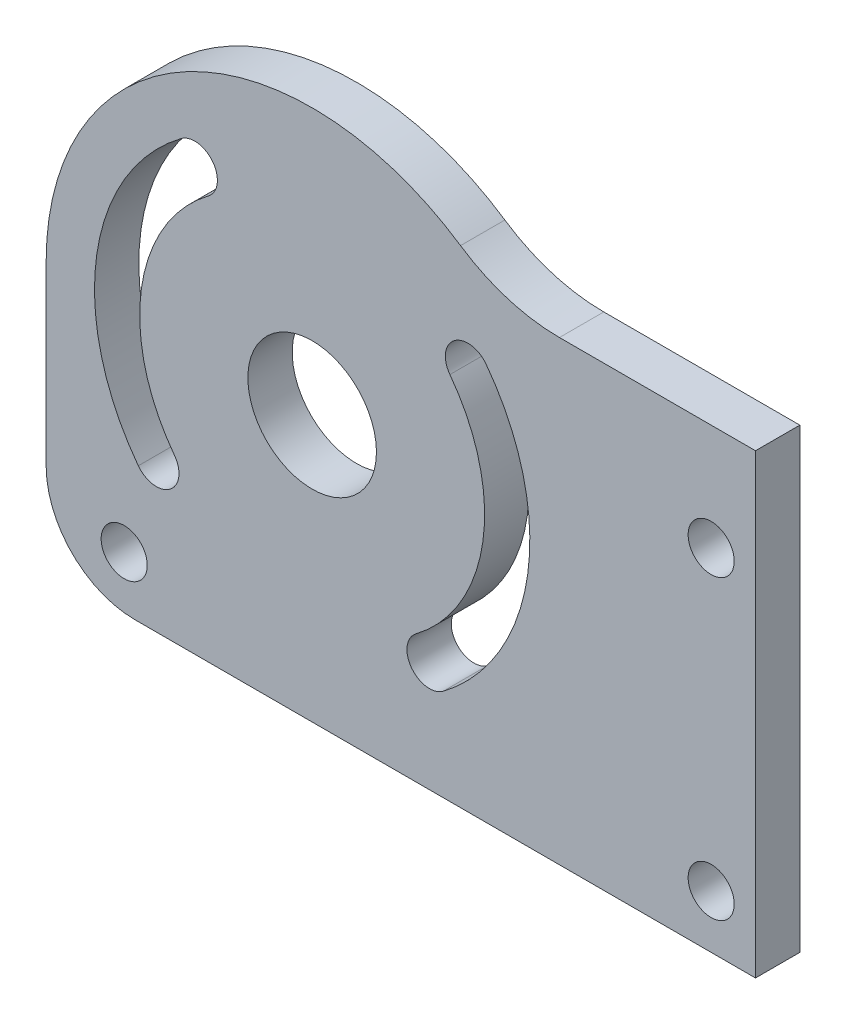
ISO-10303-21;
HEADER;
FILE_DESCRIPTION(('STEP AP214'),'2;1');
FILE_NAME('part.step','',(''),(''),'','','');
FILE_SCHEMA(('AUTOMOTIVE_DESIGN { 1 0 10303 214 1 1 1 1 }'));
ENDSEC;
DATA;
#1=APPLICATION_CONTEXT('core data for automotive mechanical design processes');
#2=APPLICATION_PROTOCOL_DEFINITION('international standard','automotive_design',2000,#1);
#3=PRODUCT_CONTEXT('',#1,'mechanical');
#4=PRODUCT('Part','Part','',(#3));
#5=PRODUCT_RELATED_PRODUCT_CATEGORY('part','',(#4));
#6=PRODUCT_DEFINITION_FORMATION('','',#4);
#7=PRODUCT_DEFINITION_CONTEXT('part definition',#1,'design');
#8=PRODUCT_DEFINITION('design','',#6,#7);
#9=PRODUCT_DEFINITION_SHAPE('','',#8);
#10=(LENGTH_UNIT() NAMED_UNIT(*) SI_UNIT(.MILLI.,.METRE.));
#11=(NAMED_UNIT(*) PLANE_ANGLE_UNIT() SI_UNIT($,.RADIAN.));
#12=(NAMED_UNIT(*) SI_UNIT($,.STERADIAN.) SOLID_ANGLE_UNIT());
#13=UNCERTAINTY_MEASURE_WITH_UNIT(LENGTH_MEASURE(1.E-05),#10,'distance_accuracy_value','');
#14=(GEOMETRIC_REPRESENTATION_CONTEXT(3) GLOBAL_UNCERTAINTY_ASSIGNED_CONTEXT((#13)) GLOBAL_UNIT_ASSIGNED_CONTEXT((#10,
#11,#12)) REPRESENTATION_CONTEXT('',''));
#15=CARTESIAN_POINT('',(0.,0.,0.));
#16=DIRECTION('',(0.,0.,1.));
#17=DIRECTION('',(1.,0.,0.));
#18=AXIS2_PLACEMENT_3D('',#15,#16,#17);
#19=CARTESIAN_POINT('',(-30.0000000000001,-20.0000000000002,4.99999999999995));
#20=DIRECTION('',(0.,0.,1.));
#21=DIRECTION('',(1.,0.,0.));
#22=AXIS2_PLACEMENT_3D('',#19,#20,#21);
#23=PLANE('',#22);
#24=CARTESIAN_POINT('',(-10.0000000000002,0.,4.99999999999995));
#25=DIRECTION('',(0.,0.,-1.));
#26=DIRECTION('',(-1.,0.,0.));
#27=AXIS2_PLACEMENT_3D('',#24,#25,#26);
#28=CIRCLE('',#27,19.45);
#29=CARTESIAN_POINT('',(-25.5334606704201,-11.7053022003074,5.));
#30=VERTEX_POINT('',#29);
#31=CARTESIAN_POINT('',(-21.7053022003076,15.5334606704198,5.));
#32=VERTEX_POINT('',#31);
#33=EDGE_CURVE('E55',#30,#32,#28,.T.);
#34=ORIENTED_EDGE('',*,*,#33,.F.);
#35=CARTESIAN_POINT('',(-27.5699812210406,-13.2399305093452,5.));
#36=DIRECTION('',(0.,0.,1.));
#37=DIRECTION('',(-1.,0.,0.));
#38=AXIS2_PLACEMENT_3D('',#35,#36,#37);
#39=CIRCLE('',#38,2.55);
#40=CARTESIAN_POINT('',(-29.6065017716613,-14.7745588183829,5.));
#41=VERTEX_POINT('',#40);
#42=EDGE_CURVE('E164',#41,#30,#39,.T.);
#43=ORIENTED_EDGE('',*,*,#42,.F.);
#44=CARTESIAN_POINT('',(-10.0000000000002,0.,4.99999999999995));
#45=DIRECTION('',(0.,0.,1.));
#46=DIRECTION('',(-1.,0.,0.));
#47=AXIS2_PLACEMENT_3D('',#44,#45,#46);
#48=CIRCLE('',#47,24.55);
#49=CARTESIAN_POINT('',(-24.7745588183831,19.6065017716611,4.99999999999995));
#50=VERTEX_POINT('',#49);
#51=EDGE_CURVE('E149',#50,#41,#48,.T.);
#52=ORIENTED_EDGE('',*,*,#51,.F.);
#53=CARTESIAN_POINT('',(-23.2399305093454,17.5699812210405,4.99999999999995));
#54=DIRECTION('',(0.,0.,1.));
#55=DIRECTION('',(-1.,0.,0.));
#56=AXIS2_PLACEMENT_3D('',#53,#54,#55);
#57=CIRCLE('',#56,2.55);
#58=EDGE_CURVE('E158',#32,#50,#57,.T.);
#59=ORIENTED_EDGE('',*,*,#58,.F.);
#60=EDGE_LOOP('',(#34,#43,#52,#59));
#61=FACE_BOUND('',#60,.T.);
#62=CARTESIAN_POINT('',(-10.0000000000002,0.,4.99999999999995));
#63=DIRECTION('',(0.,0.,1.));
#64=DIRECTION('',(1.,0.,0.));
#65=AXIS2_PLACEMENT_3D('',#62,#63,#64);
#66=CIRCLE('',#65,7.25);
#67=CARTESIAN_POINT('',(-2.75000000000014,0.,4.99999999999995));
#68=VERTEX_POINT('',#67);
#69=EDGE_CURVE('E180',#68,#68,#66,.T.);
#70=ORIENTED_EDGE('',*,*,#69,.F.);
#71=EDGE_LOOP('',(#70));
#72=FACE_BOUND('',#71,.T.);
#73=CARTESIAN_POINT('',(-10.0000000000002,0.,4.99999999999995));
#74=DIRECTION('',(0.,0.,-1.));
#75=DIRECTION('',(1.,0.,0.));
#76=AXIS2_PLACEMENT_3D('',#73,#74,#75);
#77=CIRCLE('',#76,19.45);
#78=CARTESIAN_POINT('',(5.5334606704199,11.7053022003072,5.));
#79=VERTEX_POINT('',#78);
#80=CARTESIAN_POINT('',(1.70530220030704,-15.53346067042,5.));
#81=VERTEX_POINT('',#80);
#82=EDGE_CURVE('E188',#79,#81,#77,.T.);
#83=ORIENTED_EDGE('',*,*,#82,.F.);
#84=CARTESIAN_POINT('',(7.56998122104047,13.239930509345,5.));
#85=DIRECTION('',(0.,0.,1.));
#86=DIRECTION('',(1.,0.,0.));
#87=AXIS2_PLACEMENT_3D('',#84,#85,#86);
#88=CIRCLE('',#87,2.55);
#89=CARTESIAN_POINT('',(9.60650177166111,14.7745588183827,4.99999999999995));
#90=VERTEX_POINT('',#89);
#91=EDGE_CURVE('E196',#90,#79,#88,.T.);
#92=ORIENTED_EDGE('',*,*,#91,.F.);
#93=CARTESIAN_POINT('',(-10.0000000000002,0.,4.99999999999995));
#94=DIRECTION('',(0.,0.,1.));
#95=DIRECTION('',(1.,0.,0.));
#96=AXIS2_PLACEMENT_3D('',#93,#94,#95);
#97=CIRCLE('',#96,24.55);
#98=CARTESIAN_POINT('',(4.77455881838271,-19.6065017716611,5.));
#99=VERTEX_POINT('',#98);
#100=EDGE_CURVE('E193',#99,#90,#97,.T.);
#101=ORIENTED_EDGE('',*,*,#100,.F.);
#102=CARTESIAN_POINT('',(3.23993050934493,-17.5699812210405,5.));
#103=DIRECTION('',(0.,0.,1.));
#104=DIRECTION('',(1.,0.,0.));
#105=AXIS2_PLACEMENT_3D('',#102,#103,#104);
#106=CIRCLE('',#105,2.55);
#107=EDGE_CURVE('E190',#81,#99,#106,.T.);
#108=ORIENTED_EDGE('',*,*,#107,.F.);
#109=EDGE_LOOP('',(#83,#92,#101,#108));
#110=FACE_BOUND('',#109,.T.);
#111=CARTESIAN_POINT('',(35.0000000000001,-24.0000000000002,4.99999999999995));
#112=DIRECTION('',(0.,0.,1.));
#113=DIRECTION('',(1.,0.,0.));
#114=AXIS2_PLACEMENT_3D('',#111,#112,#113);
#115=CIRCLE('',#114,2.6);
#116=CARTESIAN_POINT('',(37.6000000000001,-24.0000000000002,4.99999999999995));
#117=VERTEX_POINT('',#116);
#118=EDGE_CURVE('E229',#117,#117,#115,.T.);
#119=ORIENTED_EDGE('',*,*,#118,.F.);
#120=EDGE_LOOP('',(#119));
#121=FACE_BOUND('',#120,.T.);
#122=DIRECTION('',(0.,1.,0.));
#123=VECTOR('',#122,1.);
#124=CARTESIAN_POINT('',(40.0000000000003,21.5000000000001,4.99999999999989));
#125=LINE('',#124,#123);
#126=CARTESIAN_POINT('',(40.0000000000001,-30.0000000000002,4.99999999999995));
#127=VERTEX_POINT('',#126);
#128=CARTESIAN_POINT('',(40.0000000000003,21.5000000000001,4.99999999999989));
#129=VERTEX_POINT('',#128);
#130=EDGE_CURVE('E253',#127,#129,#125,.T.);
#131=ORIENTED_EDGE('',*,*,#130,.T.);
#132=DIRECTION('',(-1.,0.,0.));
#133=VECTOR('',#132,1.);
#134=CARTESIAN_POINT('',(40.0000000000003,21.5000000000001,4.99999999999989));
#135=LINE('',#134,#133);
#136=CARTESIAN_POINT('',(17.8881695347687,21.5000000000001,4.99999999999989));
#137=VERTEX_POINT('',#136);
#138=EDGE_CURVE('E256',#129,#137,#135,.T.);
#139=ORIENTED_EDGE('',*,*,#138,.T.);
#140=CARTESIAN_POINT('',(17.8881695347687,41.5000000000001,4.99999999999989));
#141=DIRECTION('',(0.,0.,-1.));
#142=DIRECTION('',(1.,0.,0.));
#143=AXIS2_PLACEMENT_3D('',#140,#141,#142);
#144=CIRCLE('',#143,20.);
#145=CARTESIAN_POINT('',(6.73290172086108,24.9000000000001,5.));
#146=VERTEX_POINT('',#145);
#147=EDGE_CURVE('E258',#137,#146,#144,.T.);
#148=ORIENTED_EDGE('',*,*,#147,.T.);
#149=CARTESIAN_POINT('',(-10.,0.,5.));
#150=DIRECTION('',(0.,0.,1.));
#151=DIRECTION('',(1.,0.,0.));
#152=AXIS2_PLACEMENT_3D('',#149,#150,#151);
#153=CIRCLE('',#152,30.);
#154=CARTESIAN_POINT('',(-40.0000000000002,0.,4.99999999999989));
#155=VERTEX_POINT('',#154);
#156=EDGE_CURVE('E260',#146,#155,#153,.T.);
#157=ORIENTED_EDGE('',*,*,#156,.T.);
#158=DIRECTION('',(0.,-1.,0.));
#159=VECTOR('',#158,1.);
#160=CARTESIAN_POINT('',(-40.0000000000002,0.,4.99999999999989));
#161=LINE('',#160,#159);
#162=CARTESIAN_POINT('',(-40.0000000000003,-20.,4.99999999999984));
#163=VERTEX_POINT('',#162);
#164=EDGE_CURVE('E262',#155,#163,#161,.T.);
#165=ORIENTED_EDGE('',*,*,#164,.T.);
#166=CARTESIAN_POINT('',(-30.0000000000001,-20.0000000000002,4.99999999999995));
#167=DIRECTION('',(0.,0.,1.));
#168=DIRECTION('',(1.,0.,0.));
#169=AXIS2_PLACEMENT_3D('',#166,#167,#168);
#170=CIRCLE('',#169,10.);
#171=CARTESIAN_POINT('',(-30.0000000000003,-30.0000000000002,5.));
#172=VERTEX_POINT('',#171);
#173=EDGE_CURVE('E264',#163,#172,#170,.T.);
#174=ORIENTED_EDGE('',*,*,#173,.T.);
#175=DIRECTION('',(1.,0.,0.));
#176=VECTOR('',#175,1.);
#177=CARTESIAN_POINT('',(-30.0000000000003,-30.0000000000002,5.));
#178=LINE('',#177,#176);
#179=EDGE_CURVE('E266',#172,#127,#178,.T.);
#180=ORIENTED_EDGE('',*,*,#179,.T.);
#181=EDGE_LOOP('',(#131,#139,#148,#157,#165,#174,#180));
#182=FACE_BOUND('',#181,.T.);
#183=CARTESIAN_POINT('',(34.9999999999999,9.4999999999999,4.99999999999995));
#184=DIRECTION('',(0.,0.,1.));
#185=DIRECTION('',(1.,0.,0.));
#186=AXIS2_PLACEMENT_3D('',#183,#184,#185);
#187=CIRCLE('',#186,2.6);
#188=CARTESIAN_POINT('',(37.5999999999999,9.4999999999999,4.99999999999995));
#189=VERTEX_POINT('',#188);
#190=EDGE_CURVE('E235',#189,#189,#187,.T.);
#191=ORIENTED_EDGE('',*,*,#190,.F.);
#192=EDGE_LOOP('',(#191));
#193=FACE_BOUND('',#192,.T.);
#194=CARTESIAN_POINT('',(-31.2000000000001,-24.0000000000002,4.99999999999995));
#195=DIRECTION('',(0.,0.,1.));
#196=DIRECTION('',(1.,0.,0.));
#197=AXIS2_PLACEMENT_3D('',#194,#195,#196);
#198=CIRCLE('',#197,2.6);
#199=CARTESIAN_POINT('',(-28.6000000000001,-24.0000000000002,4.99999999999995));
#200=VERTEX_POINT('',#199);
#201=EDGE_CURVE('E223',#200,#200,#198,.T.);
#202=ORIENTED_EDGE('',*,*,#201,.F.);
#203=EDGE_LOOP('',(#202));
#204=FACE_BOUND('',#203,.T.);
#205=ADVANCED_FACE('F40',(#61,#72,#110,#121,#182,#193,#204),#23,.T.);
#206=CARTESIAN_POINT('',(-30.0000000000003,-20.0000000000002,0.));
#207=DIRECTION('',(0.,0.,1.));
#208=DIRECTION('',(1.,0.,0.));
#209=AXIS2_PLACEMENT_3D('',#206,#207,#208);
#210=PLANE('',#209);
#211=CARTESIAN_POINT('',(-27.5699812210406,-13.2399305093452,0.));
#212=DIRECTION('',(0.,0.,1.));
#213=DIRECTION('',(-1.,0.,0.));
#214=AXIS2_PLACEMENT_3D('',#211,#212,#213);
#215=CIRCLE('',#214,2.55);
#216=CARTESIAN_POINT('',(-29.6065017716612,-14.7745588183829,0.));
#217=VERTEX_POINT('',#216);
#218=CARTESIAN_POINT('',(-25.5334606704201,-11.7053022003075,0.));
#219=VERTEX_POINT('',#218);
#220=EDGE_CURVE('E175',#217,#219,#215,.T.);
#221=ORIENTED_EDGE('',*,*,#220,.T.);
#222=CARTESIAN_POINT('',(-10.0000000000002,0.,0.));
#223=DIRECTION('',(0.,0.,-1.));
#224=DIRECTION('',(-1.,0.,0.));
#225=AXIS2_PLACEMENT_3D('',#222,#223,#224);
#226=CIRCLE('',#225,19.45);
#227=CARTESIAN_POINT('',(-21.7053022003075,15.5334606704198,0.));
#228=VERTEX_POINT('',#227);
#229=EDGE_CURVE('E166',#219,#228,#226,.T.);
#230=ORIENTED_EDGE('',*,*,#229,.T.);
#231=CARTESIAN_POINT('',(-23.2399305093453,17.5699812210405,0.));
#232=DIRECTION('',(0.,0.,1.));
#233=DIRECTION('',(-1.,0.,0.));
#234=AXIS2_PLACEMENT_3D('',#231,#232,#233);
#235=CIRCLE('',#234,2.55);
#236=CARTESIAN_POINT('',(-24.7745588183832,19.6065017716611,0.));
#237=VERTEX_POINT('',#236);
#238=EDGE_CURVE('E172',#228,#237,#235,.T.);
#239=ORIENTED_EDGE('',*,*,#238,.T.);
#240=CARTESIAN_POINT('',(-10.0000000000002,0.,0.));
#241=DIRECTION('',(0.,0.,1.));
#242=DIRECTION('',(-1.,0.,0.));
#243=AXIS2_PLACEMENT_3D('',#240,#241,#242);
#244=CIRCLE('',#243,24.55);
#245=EDGE_CURVE('E63',#237,#217,#244,.T.);
#246=ORIENTED_EDGE('',*,*,#245,.T.);
#247=EDGE_LOOP('',(#221,#230,#239,#246));
#248=FACE_BOUND('',#247,.T.);
#249=CARTESIAN_POINT('',(-10.0000000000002,0.,0.));
#250=DIRECTION('',(0.,0.,1.));
#251=DIRECTION('',(1.,0.,0.));
#252=AXIS2_PLACEMENT_3D('',#249,#250,#251);
#253=CIRCLE('',#252,7.25);
#254=CARTESIAN_POINT('',(-2.75000000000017,0.,0.));
#255=VERTEX_POINT('',#254);
#256=EDGE_CURVE('E185',#255,#255,#253,.T.);
#257=ORIENTED_EDGE('',*,*,#256,.T.);
#258=EDGE_LOOP('',(#257));
#259=FACE_BOUND('',#258,.T.);
#260=CARTESIAN_POINT('',(7.56998122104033,13.239930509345,0.));
#261=DIRECTION('',(0.,0.,1.));
#262=DIRECTION('',(1.,0.,0.));
#263=AXIS2_PLACEMENT_3D('',#260,#261,#262);
#264=CIRCLE('',#263,2.55);
#265=CARTESIAN_POINT('',(9.60650177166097,14.7745588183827,-1.11022302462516E-13));
#266=VERTEX_POINT('',#265);
#267=CARTESIAN_POINT('',(5.53346067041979,11.7053022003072,0.));
#268=VERTEX_POINT('',#267);
#269=EDGE_CURVE('E208',#266,#268,#264,.T.);
#270=ORIENTED_EDGE('',*,*,#269,.T.);
#271=CARTESIAN_POINT('',(-10.0000000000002,0.,0.));
#272=DIRECTION('',(0.,0.,-1.));
#273=DIRECTION('',(1.,0.,0.));
#274=AXIS2_PLACEMENT_3D('',#271,#272,#273);
#275=CIRCLE('',#274,19.45);
#276=CARTESIAN_POINT('',(1.70530220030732,-15.53346067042,0.));
#277=VERTEX_POINT('',#276);
#278=EDGE_CURVE('E199',#268,#277,#275,.T.);
#279=ORIENTED_EDGE('',*,*,#278,.T.);
#280=CARTESIAN_POINT('',(3.23993050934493,-17.5699812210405,0.));
#281=DIRECTION('',(0.,0.,1.));
#282=DIRECTION('',(1.,0.,0.));
#283=AXIS2_PLACEMENT_3D('',#280,#281,#282);
#284=CIRCLE('',#283,2.55);
#285=CARTESIAN_POINT('',(4.77455881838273,-19.6065017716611,0.));
#286=VERTEX_POINT('',#285);
#287=EDGE_CURVE('E202',#277,#286,#284,.T.);
#288=ORIENTED_EDGE('',*,*,#287,.T.);
#289=CARTESIAN_POINT('',(-10.0000000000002,0.,0.));
#290=DIRECTION('',(0.,0.,1.));
#291=DIRECTION('',(1.,0.,0.));
#292=AXIS2_PLACEMENT_3D('',#289,#290,#291);
#293=CIRCLE('',#292,24.55);
#294=EDGE_CURVE('E205',#286,#266,#293,.T.);
#295=ORIENTED_EDGE('',*,*,#294,.T.);
#296=EDGE_LOOP('',(#270,#279,#288,#295));
#297=FACE_BOUND('',#296,.T.);
#298=CARTESIAN_POINT('',(35.0000000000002,-24.0000000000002,0.));
#299=DIRECTION('',(0.,0.,1.));
#300=DIRECTION('',(1.,0.,0.));
#301=AXIS2_PLACEMENT_3D('',#298,#299,#300);
#302=CIRCLE('',#301,2.6);
#303=CARTESIAN_POINT('',(37.6000000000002,-24.0000000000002,0.));
#304=VERTEX_POINT('',#303);
#305=EDGE_CURVE('E226',#304,#304,#302,.T.);
#306=ORIENTED_EDGE('',*,*,#305,.T.);
#307=EDGE_LOOP('',(#306));
#308=FACE_BOUND('',#307,.T.);
#309=DIRECTION('',(0.,1.,0.));
#310=VECTOR('',#309,1.);
#311=CARTESIAN_POINT('',(40.0000000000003,21.5000000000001,-1.11022302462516E-13));
#312=LINE('',#311,#310);
#313=CARTESIAN_POINT('',(40.0000000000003,-30.0000000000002,0.));
#314=VERTEX_POINT('',#313);
#315=CARTESIAN_POINT('',(40.0000000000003,21.5000000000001,-1.11022302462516E-13));
#316=VERTEX_POINT('',#315);
#317=EDGE_CURVE('E238',#314,#316,#312,.T.);
#318=ORIENTED_EDGE('',*,*,#317,.F.);
#319=DIRECTION('',(1.,0.,0.));
#320=VECTOR('',#319,1.);
#321=CARTESIAN_POINT('',(-30.0000000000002,-30.0000000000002,0.));
#322=LINE('',#321,#320);
#323=CARTESIAN_POINT('',(-30.0000000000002,-30.0000000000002,0.));
#324=VERTEX_POINT('',#323);
#325=EDGE_CURVE('E251',#324,#314,#322,.T.);
#326=ORIENTED_EDGE('',*,*,#325,.F.);
#327=CARTESIAN_POINT('',(-30.0000000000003,-20.0000000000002,0.));
#328=DIRECTION('',(0.,0.,1.));
#329=DIRECTION('',(1.,0.,0.));
#330=AXIS2_PLACEMENT_3D('',#327,#328,#329);
#331=CIRCLE('',#330,10.);
#332=CARTESIAN_POINT('',(-40.0000000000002,-20.,-1.66533453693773E-13));
#333=VERTEX_POINT('',#332);
#334=EDGE_CURVE('E249',#333,#324,#331,.T.);
#335=ORIENTED_EDGE('',*,*,#334,.F.);
#336=DIRECTION('',(0.,-1.,0.));
#337=VECTOR('',#336,1.);
#338=CARTESIAN_POINT('',(-40.0000000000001,0.,0.));
#339=LINE('',#338,#337);
#340=CARTESIAN_POINT('',(-40.0000000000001,0.,0.));
#341=VERTEX_POINT('',#340);
#342=EDGE_CURVE('E247',#341,#333,#339,.T.);
#343=ORIENTED_EDGE('',*,*,#342,.F.);
#344=CARTESIAN_POINT('',(-10.0000000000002,0.,0.));
#345=DIRECTION('',(0.,0.,1.));
#346=DIRECTION('',(1.,0.,0.));
#347=AXIS2_PLACEMENT_3D('',#344,#345,#346);
#348=CIRCLE('',#347,30.);
#349=CARTESIAN_POINT('',(6.73290172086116,24.9000000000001,-1.11022302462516E-13));
#350=VERTEX_POINT('',#349);
#351=EDGE_CURVE('E245',#350,#341,#348,.T.);
#352=ORIENTED_EDGE('',*,*,#351,.F.);
#353=CARTESIAN_POINT('',(17.8881695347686,41.5000000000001,0.));
#354=DIRECTION('',(0.,0.,-1.));
#355=DIRECTION('',(1.,0.,0.));
#356=AXIS2_PLACEMENT_3D('',#353,#354,#355);
#357=CIRCLE('',#356,20.);
#358=CARTESIAN_POINT('',(17.8881695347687,21.5000000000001,0.));
#359=VERTEX_POINT('',#358);
#360=EDGE_CURVE('E243',#359,#350,#357,.T.);
#361=ORIENTED_EDGE('',*,*,#360,.F.);
#362=DIRECTION('',(-1.,0.,0.));
#363=VECTOR('',#362,1.);
#364=CARTESIAN_POINT('',(40.0000000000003,21.5000000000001,-1.11022302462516E-13));
#365=LINE('',#364,#363);
#366=EDGE_CURVE('E241',#316,#359,#365,.T.);
#367=ORIENTED_EDGE('',*,*,#366,.F.);
#368=EDGE_LOOP('',(#318,#326,#335,#343,#352,#361,#367));
#369=FACE_BOUND('',#368,.T.);
#370=CARTESIAN_POINT('',(35.,9.50000000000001,-1.66533453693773E-13));
#371=DIRECTION('',(0.,0.,1.));
#372=DIRECTION('',(1.,0.,0.));
#373=AXIS2_PLACEMENT_3D('',#370,#371,#372);
#374=CIRCLE('',#373,2.6);
#375=CARTESIAN_POINT('',(37.6,9.50000000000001,-1.66966440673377E-13));
#376=VERTEX_POINT('',#375);
#377=EDGE_CURVE('E232',#376,#376,#374,.T.);
#378=ORIENTED_EDGE('',*,*,#377,.T.);
#379=EDGE_LOOP('',(#378));
#380=FACE_BOUND('',#379,.T.);
#381=CARTESIAN_POINT('',(-31.2000000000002,-24.0000000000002,-1.11022302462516E-13));
#382=DIRECTION('',(0.,0.,1.));
#383=DIRECTION('',(1.,0.,0.));
#384=AXIS2_PLACEMENT_3D('',#381,#382,#383);
#385=CIRCLE('',#384,2.6);
#386=CARTESIAN_POINT('',(-28.6000000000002,-24.0000000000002,-1.11455289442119E-13));
#387=VERTEX_POINT('',#386);
#388=EDGE_CURVE('E214',#387,#387,#385,.T.);
#389=ORIENTED_EDGE('',*,*,#388,.T.);
#390=EDGE_LOOP('',(#389));
#391=FACE_BOUND('',#390,.T.);
#392=ADVANCED_FACE('F293',(#248,#259,#297,#308,#369,#380,#391),#210,.F.);
#393=CARTESIAN_POINT('',(40.0000000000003,21.5000000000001,4.99999999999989));
#394=DIRECTION('',(-1.,0.,0.));
#395=DIRECTION('',(0.,-1.,0.));
#396=AXIS2_PLACEMENT_3D('',#393,#394,#395);
#397=PLANE('',#396);
#398=ORIENTED_EDGE('',*,*,#317,.T.);
#399=DIRECTION('',(0.,0.,-1.));
#400=VECTOR('',#399,1.);
#401=CARTESIAN_POINT('',(40.0000000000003,21.5000000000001,4.99999999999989));
#402=LINE('',#401,#400);
#403=EDGE_CURVE('E11',#129,#316,#402,.T.);
#404=ORIENTED_EDGE('',*,*,#403,.F.);
#405=ORIENTED_EDGE('',*,*,#130,.F.);
#406=DIRECTION('',(0.,0.,-1.));
#407=VECTOR('',#406,1.);
#408=CARTESIAN_POINT('',(40.0000000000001,-30.0000000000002,4.99999999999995));
#409=LINE('',#408,#407);
#410=EDGE_CURVE('E268',#127,#314,#409,.T.);
#411=ORIENTED_EDGE('',*,*,#410,.T.);
#412=EDGE_LOOP('',(#398,#404,#405,#411));
#413=FACE_BOUND('',#412,.T.);
#414=ADVANCED_FACE('F42',(#413),#397,.F.);
#415=CARTESIAN_POINT('',(40.0000000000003,21.5000000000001,4.99999999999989));
#416=DIRECTION('',(0.,-1.,0.));
#417=DIRECTION('',(1.,0.,0.));
#418=AXIS2_PLACEMENT_3D('',#415,#416,#417);
#419=PLANE('',#418);
#420=ORIENTED_EDGE('',*,*,#366,.T.);
#421=DIRECTION('',(0.,0.,-1.));
#422=VECTOR('',#421,1.);
#423=CARTESIAN_POINT('',(17.8881695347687,21.5000000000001,4.99999999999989));
#424=LINE('',#423,#422);
#425=EDGE_CURVE('E48',#137,#359,#424,.T.);
#426=ORIENTED_EDGE('',*,*,#425,.F.);
#427=ORIENTED_EDGE('',*,*,#138,.F.);
#428=ORIENTED_EDGE('',*,*,#403,.T.);
#429=EDGE_LOOP('',(#420,#426,#427,#428));
#430=FACE_BOUND('',#429,.T.);
#431=ADVANCED_FACE('F311',(#430),#419,.F.);
#432=CARTESIAN_POINT('',(17.8881695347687,41.5000000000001,4.99999999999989));
#433=DIRECTION('',(0.,0.,-1.));
#434=DIRECTION('',(-1.,0.,0.));
#435=AXIS2_PLACEMENT_3D('',#432,#433,#434);
#436=CYLINDRICAL_SURFACE('',#435,20.);
#437=ORIENTED_EDGE('',*,*,#360,.T.);
#438=DIRECTION('',(0.,0.,-1.));
#439=VECTOR('',#438,1.);
#440=CARTESIAN_POINT('',(6.73290172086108,24.9000000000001,5.));
#441=LINE('',#440,#439);
#442=EDGE_CURVE('E280',#146,#350,#441,.T.);
#443=ORIENTED_EDGE('',*,*,#442,.F.);
#444=ORIENTED_EDGE('',*,*,#147,.F.);
#445=ORIENTED_EDGE('',*,*,#425,.T.);
#446=EDGE_LOOP('',(#437,#443,#444,#445));
#447=FACE_BOUND('',#446,.T.);
#448=ADVANCED_FACE('F287',(#447),#436,.F.);
#449=CARTESIAN_POINT('',(-10.,0.,5.));
#450=DIRECTION('',(0.,0.,-1.));
#451=DIRECTION('',(-1.,0.,0.));
#452=AXIS2_PLACEMENT_3D('',#449,#450,#451);
#453=CYLINDRICAL_SURFACE('',#452,30.);
#454=ORIENTED_EDGE('',*,*,#351,.T.);
#455=DIRECTION('',(0.,0.,-1.));
#456=VECTOR('',#455,1.);
#457=CARTESIAN_POINT('',(-40.0000000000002,0.,4.99999999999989));
#458=LINE('',#457,#456);
#459=EDGE_CURVE('E277',#155,#341,#458,.T.);
#460=ORIENTED_EDGE('',*,*,#459,.F.);
#461=ORIENTED_EDGE('',*,*,#156,.F.);
#462=ORIENTED_EDGE('',*,*,#442,.T.);
#463=EDGE_LOOP('',(#454,#460,#461,#462));
#464=FACE_BOUND('',#463,.T.);
#465=ADVANCED_FACE('F299',(#464),#453,.T.);
#466=CARTESIAN_POINT('',(-40.0000000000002,0.,4.99999999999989));
#467=DIRECTION('',(1.,0.,0.));
#468=DIRECTION('',(0.,1.00000000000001,0.));
#469=AXIS2_PLACEMENT_3D('',#466,#467,#468);
#470=PLANE('',#469);
#471=ORIENTED_EDGE('',*,*,#342,.T.);
#472=DIRECTION('',(0.,0.,-1.));
#473=VECTOR('',#472,1.);
#474=CARTESIAN_POINT('',(-40.0000000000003,-20.,4.99999999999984));
#475=LINE('',#474,#473);
#476=EDGE_CURVE('E274',#163,#333,#475,.T.);
#477=ORIENTED_EDGE('',*,*,#476,.F.);
#478=ORIENTED_EDGE('',*,*,#164,.F.);
#479=ORIENTED_EDGE('',*,*,#459,.T.);
#480=EDGE_LOOP('',(#471,#477,#478,#479));
#481=FACE_BOUND('',#480,.T.);
#482=ADVANCED_FACE('F303',(#481),#470,.F.);
#483=CARTESIAN_POINT('',(-30.0000000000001,-20.0000000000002,4.99999999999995));
#484=DIRECTION('',(0.,0.,-1.));
#485=DIRECTION('',(-1.,0.,0.));
#486=AXIS2_PLACEMENT_3D('',#483,#484,#485);
#487=CYLINDRICAL_SURFACE('',#486,10.);
#488=ORIENTED_EDGE('',*,*,#334,.T.);
#489=DIRECTION('',(0.,0.,-1.));
#490=VECTOR('',#489,1.);
#491=CARTESIAN_POINT('',(-30.0000000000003,-30.0000000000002,5.));
#492=LINE('',#491,#490);
#493=EDGE_CURVE('E271',#172,#324,#492,.T.);
#494=ORIENTED_EDGE('',*,*,#493,.F.);
#495=ORIENTED_EDGE('',*,*,#173,.F.);
#496=ORIENTED_EDGE('',*,*,#476,.T.);
#497=EDGE_LOOP('',(#488,#494,#495,#496));
#498=FACE_BOUND('',#497,.T.);
#499=ADVANCED_FACE('F319',(#498),#487,.T.);
#500=CARTESIAN_POINT('',(-30.0000000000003,-30.0000000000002,5.));
#501=DIRECTION('',(0.,1.,0.));
#502=DIRECTION('',(-1.,0.,0.));
#503=AXIS2_PLACEMENT_3D('',#500,#501,#502);
#504=PLANE('',#503);
#505=ORIENTED_EDGE('',*,*,#325,.T.);
#506=ORIENTED_EDGE('',*,*,#410,.F.);
#507=ORIENTED_EDGE('',*,*,#179,.F.);
#508=ORIENTED_EDGE('',*,*,#493,.T.);
#509=EDGE_LOOP('',(#505,#506,#507,#508));
#510=FACE_BOUND('',#509,.T.);
#511=ADVANCED_FACE('F316',(#510),#504,.F.);
#512=CARTESIAN_POINT('',(34.9999999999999,9.4999999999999,4.99999999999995));
#513=DIRECTION('',(0.,0.,-1.));
#514=DIRECTION('',(-1.,0.,0.));
#515=AXIS2_PLACEMENT_3D('',#512,#513,#514);
#516=CYLINDRICAL_SURFACE('',#515,2.6);
#517=ORIENTED_EDGE('',*,*,#190,.T.);
#518=EDGE_LOOP('',(#517));
#519=FACE_BOUND('',#518,.T.);
#520=ORIENTED_EDGE('',*,*,#377,.F.);
#521=EDGE_LOOP('',(#520));
#522=FACE_BOUND('',#521,.T.);
#523=ADVANCED_FACE('F326',(#519,#522),#516,.F.);
#524=CARTESIAN_POINT('',(35.0000000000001,-24.0000000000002,4.99999999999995));
#525=DIRECTION('',(0.,0.,-1.));
#526=DIRECTION('',(-1.,0.,0.));
#527=AXIS2_PLACEMENT_3D('',#524,#525,#526);
#528=CYLINDRICAL_SURFACE('',#527,2.6);
#529=ORIENTED_EDGE('',*,*,#118,.T.);
#530=EDGE_LOOP('',(#529));
#531=FACE_BOUND('',#530,.T.);
#532=ORIENTED_EDGE('',*,*,#305,.F.);
#533=EDGE_LOOP('',(#532));
#534=FACE_BOUND('',#533,.T.);
#535=ADVANCED_FACE('F339',(#531,#534),#528,.F.);
#536=CARTESIAN_POINT('',(-31.2000000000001,-24.0000000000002,4.99999999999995));
#537=DIRECTION('',(0.,0.,-1.));
#538=DIRECTION('',(-1.,0.,0.));
#539=AXIS2_PLACEMENT_3D('',#536,#537,#538);
#540=CYLINDRICAL_SURFACE('',#539,2.6);
#541=ORIENTED_EDGE('',*,*,#201,.T.);
#542=EDGE_LOOP('',(#541));
#543=FACE_BOUND('',#542,.T.);
#544=ORIENTED_EDGE('',*,*,#388,.F.);
#545=EDGE_LOOP('',(#544));
#546=FACE_BOUND('',#545,.T.);
#547=ADVANCED_FACE('F343',(#543,#546),#540,.F.);
#548=CARTESIAN_POINT('',(-10.0000000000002,0.,0.));
#549=DIRECTION('',(0.,0.,1.));
#550=DIRECTION('',(1.,0.,0.));
#551=AXIS2_PLACEMENT_3D('',#548,#549,#550);
#552=CYLINDRICAL_SURFACE('',#551,19.45);
#553=ORIENTED_EDGE('',*,*,#82,.T.);
#554=DIRECTION('',(0.,0.,1.));
#555=VECTOR('',#554,1.);
#556=CARTESIAN_POINT('',(1.70530220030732,-15.53346067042,0.));
#557=LINE('',#556,#555);
#558=EDGE_CURVE('E211',#277,#81,#557,.T.);
#559=ORIENTED_EDGE('',*,*,#558,.F.);
#560=ORIENTED_EDGE('',*,*,#278,.F.);
#561=DIRECTION('',(0.,0.,1.));
#562=VECTOR('',#561,1.);
#563=CARTESIAN_POINT('',(5.53346067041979,11.7053022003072,0.));
#564=LINE('',#563,#562);
#565=EDGE_CURVE('E212',#268,#79,#564,.T.);
#566=ORIENTED_EDGE('',*,*,#565,.T.);
#567=EDGE_LOOP('',(#553,#559,#560,#566));
#568=FACE_BOUND('',#567,.T.);
#569=ADVANCED_FACE('F347',(#568),#552,.T.);
#570=CARTESIAN_POINT('',(7.56998122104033,13.239930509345,0.));
#571=DIRECTION('',(0.,0.,1.));
#572=DIRECTION('',(1.,0.,0.));
#573=AXIS2_PLACEMENT_3D('',#570,#571,#572);
#574=CYLINDRICAL_SURFACE('',#573,2.55);
#575=ORIENTED_EDGE('',*,*,#91,.T.);
#576=ORIENTED_EDGE('',*,*,#565,.F.);
#577=ORIENTED_EDGE('',*,*,#269,.F.);
#578=DIRECTION('',(0.,0.,1.));
#579=VECTOR('',#578,1.);
#580=CARTESIAN_POINT('',(9.60650177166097,14.7745588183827,-1.11022302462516E-13));
#581=LINE('',#580,#579);
#582=EDGE_CURVE('E215',#266,#90,#581,.T.);
#583=ORIENTED_EDGE('',*,*,#582,.T.);
#584=EDGE_LOOP('',(#575,#576,#577,#583));
#585=FACE_BOUND('',#584,.T.);
#586=ADVANCED_FACE('F351',(#585),#574,.F.);
#587=CARTESIAN_POINT('',(-10.0000000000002,0.,0.));
#588=DIRECTION('',(0.,0.,1.));
#589=DIRECTION('',(1.,0.,0.));
#590=AXIS2_PLACEMENT_3D('',#587,#588,#589);
#591=CYLINDRICAL_SURFACE('',#590,24.55);
#592=ORIENTED_EDGE('',*,*,#100,.T.);
#593=ORIENTED_EDGE('',*,*,#582,.F.);
#594=ORIENTED_EDGE('',*,*,#294,.F.);
#595=DIRECTION('',(0.,0.,1.));
#596=VECTOR('',#595,1.);
#597=CARTESIAN_POINT('',(4.77455881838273,-19.6065017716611,0.));
#598=LINE('',#597,#596);
#599=EDGE_CURVE('E217',#286,#99,#598,.T.);
#600=ORIENTED_EDGE('',*,*,#599,.T.);
#601=EDGE_LOOP('',(#592,#593,#594,#600));
#602=FACE_BOUND('',#601,.T.);
#603=ADVANCED_FACE('F357',(#602),#591,.F.);
#604=CARTESIAN_POINT('',(3.23993050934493,-17.5699812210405,0.));
#605=DIRECTION('',(0.,0.,1.));
#606=DIRECTION('',(1.,0.,0.));
#607=AXIS2_PLACEMENT_3D('',#604,#605,#606);
#608=CYLINDRICAL_SURFACE('',#607,2.55);
#609=ORIENTED_EDGE('',*,*,#107,.T.);
#610=ORIENTED_EDGE('',*,*,#599,.F.);
#611=ORIENTED_EDGE('',*,*,#287,.F.);
#612=ORIENTED_EDGE('',*,*,#558,.T.);
#613=EDGE_LOOP('',(#609,#610,#611,#612));
#614=FACE_BOUND('',#613,.T.);
#615=ADVANCED_FACE('F353',(#614),#608,.F.);
#616=CARTESIAN_POINT('',(-10.0000000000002,0.,0.));
#617=DIRECTION('',(0.,0.,1.));
#618=DIRECTION('',(1.,0.,0.));
#619=AXIS2_PLACEMENT_3D('',#616,#617,#618);
#620=CYLINDRICAL_SURFACE('',#619,7.25);
#621=ORIENTED_EDGE('',*,*,#256,.F.);
#622=EDGE_LOOP('',(#621));
#623=FACE_BOUND('',#622,.T.);
#624=ORIENTED_EDGE('',*,*,#69,.T.);
#625=EDGE_LOOP('',(#624));
#626=FACE_BOUND('',#625,.T.);
#627=ADVANCED_FACE('F356',(#623,#626),#620,.F.);
#628=CARTESIAN_POINT('',(-10.0000000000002,0.,0.));
#629=DIRECTION('',(0.,0.,1.));
#630=DIRECTION('',(1.,0.,0.));
#631=AXIS2_PLACEMENT_3D('',#628,#629,#630);
#632=CYLINDRICAL_SURFACE('',#631,19.45);
#633=ORIENTED_EDGE('',*,*,#33,.T.);
#634=DIRECTION('',(0.,0.,1.));
#635=VECTOR('',#634,1.);
#636=CARTESIAN_POINT('',(-21.7053022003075,15.5334606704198,0.));
#637=LINE('',#636,#635);
#638=EDGE_CURVE('E155',#228,#32,#637,.T.);
#639=ORIENTED_EDGE('',*,*,#638,.F.);
#640=ORIENTED_EDGE('',*,*,#229,.F.);
#641=DIRECTION('',(0.,0.,1.));
#642=VECTOR('',#641,1.);
#643=CARTESIAN_POINT('',(-25.5334606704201,-11.7053022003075,0.));
#644=LINE('',#643,#642);
#645=EDGE_CURVE('E178',#219,#30,#644,.T.);
#646=ORIENTED_EDGE('',*,*,#645,.T.);
#647=EDGE_LOOP('',(#633,#639,#640,#646));
#648=FACE_BOUND('',#647,.T.);
#649=ADVANCED_FACE('F367',(#648),#632,.T.);
#650=CARTESIAN_POINT('',(-27.5699812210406,-13.2399305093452,0.));
#651=DIRECTION('',(0.,0.,1.));
#652=DIRECTION('',(1.,0.,0.));
#653=AXIS2_PLACEMENT_3D('',#650,#651,#652);
#654=CYLINDRICAL_SURFACE('',#653,2.55);
#655=ORIENTED_EDGE('',*,*,#42,.T.);
#656=ORIENTED_EDGE('',*,*,#645,.F.);
#657=ORIENTED_EDGE('',*,*,#220,.F.);
#658=DIRECTION('',(0.,0.,1.));
#659=VECTOR('',#658,1.);
#660=CARTESIAN_POINT('',(-29.6065017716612,-14.7745588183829,0.));
#661=LINE('',#660,#659);
#662=EDGE_CURVE('E154',#217,#41,#661,.T.);
#663=ORIENTED_EDGE('',*,*,#662,.T.);
#664=EDGE_LOOP('',(#655,#656,#657,#663));
#665=FACE_BOUND('',#664,.T.);
#666=ADVANCED_FACE('F371',(#665),#654,.F.);
#667=CARTESIAN_POINT('',(-10.0000000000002,0.,0.));
#668=DIRECTION('',(0.,0.,1.));
#669=DIRECTION('',(1.,0.,0.));
#670=AXIS2_PLACEMENT_3D('',#667,#668,#669);
#671=CYLINDRICAL_SURFACE('',#670,24.55);
#672=ORIENTED_EDGE('',*,*,#51,.T.);
#673=ORIENTED_EDGE('',*,*,#662,.F.);
#674=ORIENTED_EDGE('',*,*,#245,.F.);
#675=DIRECTION('',(0.,0.,1.));
#676=VECTOR('',#675,1.);
#677=CARTESIAN_POINT('',(-24.7745588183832,19.6065017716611,0.));
#678=LINE('',#677,#676);
#679=EDGE_CURVE('E145',#237,#50,#678,.T.);
#680=ORIENTED_EDGE('',*,*,#679,.T.);
#681=EDGE_LOOP('',(#672,#673,#674,#680));
#682=FACE_BOUND('',#681,.T.);
#683=ADVANCED_FACE('F147',(#682),#671,.F.);
#684=CARTESIAN_POINT('',(-23.2399305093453,17.5699812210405,0.));
#685=DIRECTION('',(0.,0.,1.));
#686=DIRECTION('',(1.,0.,0.));
#687=AXIS2_PLACEMENT_3D('',#684,#685,#686);
#688=CYLINDRICAL_SURFACE('',#687,2.55);
#689=ORIENTED_EDGE('',*,*,#58,.T.);
#690=ORIENTED_EDGE('',*,*,#679,.F.);
#691=ORIENTED_EDGE('',*,*,#238,.F.);
#692=ORIENTED_EDGE('',*,*,#638,.T.);
#693=EDGE_LOOP('',(#689,#690,#691,#692));
#694=FACE_BOUND('',#693,.T.);
#695=ADVANCED_FACE('F159',(#694),#688,.F.);
#696=CLOSED_SHELL('',(#205,#392,#414,#431,#448,#465,#482,#499,#511,#523,#535,#547,#569,#586,
#603,#615,#627,#649,#666,#683,#695));
#697=MANIFOLD_SOLID_BREP('B2',#696);
#698=ADVANCED_BREP_SHAPE_REPRESENTATION('',(#18,#697),#14);
#699=SHAPE_DEFINITION_REPRESENTATION(#9,#698);
ENDSEC;
END-ISO-10303-21;
